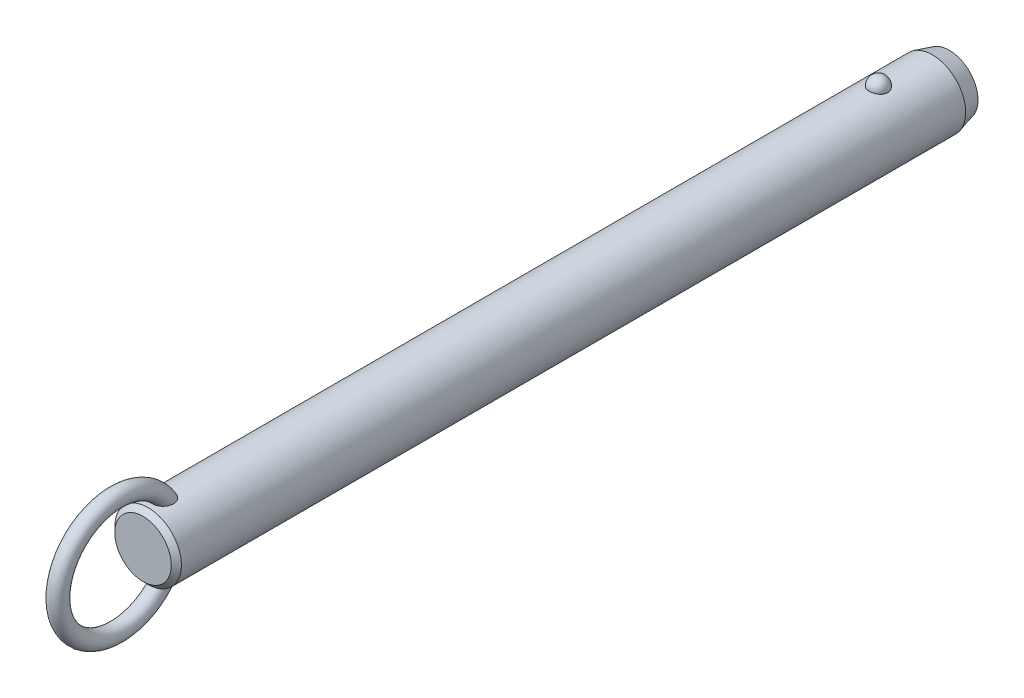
ISO-10303-21;
HEADER;
FILE_DESCRIPTION(('STEP AP214'),'2;1');
FILE_NAME('part.step','',(''),(''),'','','');
FILE_SCHEMA(('AUTOMOTIVE_DESIGN { 1 0 10303 214 1 1 1 1 }'));
ENDSEC;
DATA;
#1=APPLICATION_CONTEXT('core data for automotive mechanical design processes');
#2=APPLICATION_PROTOCOL_DEFINITION('international standard','automotive_design',2000,#1);
#3=PRODUCT_CONTEXT('',#1,'mechanical');
#4=PRODUCT('Part','Part','',(#3));
#5=PRODUCT_RELATED_PRODUCT_CATEGORY('part','',(#4));
#6=PRODUCT_DEFINITION_FORMATION('','',#4);
#7=PRODUCT_DEFINITION_CONTEXT('part definition',#1,'design');
#8=PRODUCT_DEFINITION('design','',#6,#7);
#9=PRODUCT_DEFINITION_SHAPE('','',#8);
#10=(LENGTH_UNIT() NAMED_UNIT(*) SI_UNIT(.MILLI.,.METRE.));
#11=(NAMED_UNIT(*) PLANE_ANGLE_UNIT() SI_UNIT($,.RADIAN.));
#12=(NAMED_UNIT(*) SI_UNIT($,.STERADIAN.) SOLID_ANGLE_UNIT());
#13=UNCERTAINTY_MEASURE_WITH_UNIT(LENGTH_MEASURE(1.E-05),#10,'distance_accuracy_value','');
#14=(GEOMETRIC_REPRESENTATION_CONTEXT(3) GLOBAL_UNCERTAINTY_ASSIGNED_CONTEXT((#13)) GLOBAL_UNIT_ASSIGNED_CONTEXT((#10,
#11,#12)) REPRESENTATION_CONTEXT('',''));
#15=CARTESIAN_POINT('',(0.,0.,0.));
#16=DIRECTION('',(0.,0.,1.));
#17=DIRECTION('',(1.,0.,0.));
#18=AXIS2_PLACEMENT_3D('',#15,#16,#17);
#19=CARTESIAN_POINT('',(0.,0.,162.6));
#20=DIRECTION('',(0.,0.,-1.));
#21=DIRECTION('',(-1.,0.,0.));
#22=AXIS2_PLACEMENT_3D('',#19,#20,#21);
#23=CYLINDRICAL_SURFACE('',#22,7.9);
#24=CARTESIAN_POINT('',(2.1785689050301,7.59367088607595,-2.20000000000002));
#25=CARTESIAN_POINT('',(2.17856679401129,7.59367269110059,-2.07701843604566));
#26=CARTESIAN_POINT('',(2.16853481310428,7.59657145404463,-1.95401006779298));
#27=CARTESIAN_POINT('',(2.12864689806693,7.607843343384,-1.71147811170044));
#28=CARTESIAN_POINT('',(2.09878338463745,7.61621856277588,-1.5919558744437));
#29=CARTESIAN_POINT('',(2.0199931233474,7.63749180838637,-1.35985638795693));
#30=CARTESIAN_POINT('',(1.97107475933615,7.6503878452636,-1.24727610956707));
#31=CARTESIAN_POINT('',(1.85539377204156,7.67926115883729,-1.03213234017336));
#32=CARTESIAN_POINT('',(1.78863158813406,7.69523835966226,-0.929568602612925));
#33=CARTESIAN_POINT('',(1.63856494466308,7.7285848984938,-0.73678633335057));
#34=CARTESIAN_POINT('',(1.55518140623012,7.7459606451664,-0.646630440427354));
#35=CARTESIAN_POINT('',(1.37422937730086,7.78009978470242,-0.481747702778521));
#36=CARTESIAN_POINT('',(1.27666086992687,7.79686317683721,-0.407020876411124));
#37=CARTESIAN_POINT('',(1.07024728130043,7.82786153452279,-0.275278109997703));
#38=CARTESIAN_POINT('',(0.961434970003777,7.84210353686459,-0.218212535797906));
#39=CARTESIAN_POINT('',(0.735351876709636,7.86652194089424,-0.123146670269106));
#40=CARTESIAN_POINT('',(0.618082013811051,7.87669878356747,-0.0851443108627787));
#41=CARTESIAN_POINT('',(0.380637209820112,7.89170521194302,-0.0298158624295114));
#42=CARTESIAN_POINT('',(0.260550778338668,7.89662650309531,-0.0121347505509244));
#43=CARTESIAN_POINT('',(0.0190117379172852,7.90090003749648,0.00324379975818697));
#44=CARTESIAN_POINT('',(-0.102440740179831,7.90025280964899,0.000943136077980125));
#45=CARTESIAN_POINT('',(-0.341452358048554,7.89351056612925,-0.0233955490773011));
#46=CARTESIAN_POINT('',(-0.459042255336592,7.88749257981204,-0.0451545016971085));
#47=CARTESIAN_POINT('',(-0.688796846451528,7.87075812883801,-0.107408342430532));
#48=CARTESIAN_POINT('',(-0.800961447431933,7.86004158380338,-0.14790355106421));
#49=CARTESIAN_POINT('',(-1.01743634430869,7.83497131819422,-0.246799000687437));
#50=CARTESIAN_POINT('',(-1.12169791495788,7.82059709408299,-0.305300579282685));
#51=CARTESIAN_POINT('',(-1.31891765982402,7.78976470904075,-0.43854939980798));
#52=CARTESIAN_POINT('',(-1.41187469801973,7.77330633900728,-0.513298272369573));
#53=CARTESIAN_POINT('',(-1.58577142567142,7.73972434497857,-0.678622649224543));
#54=CARTESIAN_POINT('',(-1.66645140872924,7.72259402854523,-0.769470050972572));
#55=CARTESIAN_POINT('',(-1.81161503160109,7.68983776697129,-0.963538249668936));
#56=CARTESIAN_POINT('',(-1.87609753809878,7.6742119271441,-1.0667599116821));
#57=CARTESIAN_POINT('',(-1.98790138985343,7.6460202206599,-1.28401170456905));
#58=CARTESIAN_POINT('',(-2.03501994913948,7.63349104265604,-1.39815107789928));
#59=CARTESIAN_POINT('',(-2.10986724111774,7.6131449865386,-1.6330178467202));
#60=CARTESIAN_POINT('',(-2.1375965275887,7.60532797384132,-1.75374505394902));
#61=CARTESIAN_POINT('',(-2.17289256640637,7.5953195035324,-1.99782562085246));
#62=CARTESIAN_POINT('',(-2.18054294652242,7.59310471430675,-2.12116592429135));
#63=CARTESIAN_POINT('',(-2.17572919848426,7.59448538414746,-2.36741799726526));
#64=CARTESIAN_POINT('',(-2.1632656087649,7.59808068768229,-2.49032977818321));
#65=CARTESIAN_POINT('',(-2.11865035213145,7.61064035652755,-2.73161015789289));
#66=CARTESIAN_POINT('',(-2.08659579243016,7.61957823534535,-2.84999812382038));
#67=CARTESIAN_POINT('',(-2.00367799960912,7.64179982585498,-3.07955956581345));
#68=CARTESIAN_POINT('',(-1.9528140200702,7.65508371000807,-3.19073275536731));
#69=CARTESIAN_POINT('',(-1.83321113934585,7.68460381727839,-3.40337899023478));
#70=CARTESIAN_POINT('',(-1.76437735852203,7.70085556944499,-3.5047965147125));
#71=CARTESIAN_POINT('',(-1.61069526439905,7.73445734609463,-3.69446912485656));
#72=CARTESIAN_POINT('',(-1.52584634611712,7.75180741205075,-3.78272371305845));
#73=CARTESIAN_POINT('',(-1.34198059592,7.78574608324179,-3.94393987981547));
#74=CARTESIAN_POINT('',(-1.24291308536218,7.80233167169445,-4.01684434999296));
#75=CARTESIAN_POINT('',(-1.03352039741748,7.83281625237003,-4.14489386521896));
#76=CARTESIAN_POINT('',(-0.92319600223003,7.84671543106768,-4.20004014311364));
#77=CARTESIAN_POINT('',(-0.695822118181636,7.87011575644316,-4.29042017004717));
#78=CARTESIAN_POINT('',(-0.578872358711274,7.87966903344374,-4.32589112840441));
#79=CARTESIAN_POINT('',(-0.340410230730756,7.8935652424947,-4.37692226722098));
#80=CARTESIAN_POINT('',(-0.218898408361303,7.89790879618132,-4.39248482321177));
#81=CARTESIAN_POINT('',(0.0228107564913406,7.90087453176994,-4.40314405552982));
#82=CARTESIAN_POINT('',(0.142990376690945,7.89960185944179,-4.39861683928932));
#83=CARTESIAN_POINT('',(0.380829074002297,7.89171262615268,-4.37008293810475));
#84=CARTESIAN_POINT('',(0.498488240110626,7.8850962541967,-4.34607694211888));
#85=CARTESIAN_POINT('',(0.727535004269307,7.86726442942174,-4.27939317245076));
#86=CARTESIAN_POINT('',(0.838944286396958,7.85606616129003,-4.23678512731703));
#87=CARTESIAN_POINT('',(1.05295421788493,7.83025654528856,-4.13408348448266));
#88=CARTESIAN_POINT('',(1.15555431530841,7.81564498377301,-4.07398879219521));
#89=CARTESIAN_POINT('',(1.35076763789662,7.7843022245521,-3.93687432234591));
#90=CARTESIAN_POINT('',(1.4432046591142,7.76754209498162,-3.85961036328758));
#91=CARTESIAN_POINT('',(1.6139111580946,7.73387857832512,-3.69076949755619));
#92=CARTESIAN_POINT('',(1.6921781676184,7.71697516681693,-3.59919010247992));
#93=CARTESIAN_POINT('',(1.83380875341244,7.6845643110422,-3.40247278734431));
#94=CARTESIAN_POINT('',(1.89689280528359,7.66908588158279,-3.29712873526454));
#95=CARTESIAN_POINT('',(2.0047823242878,7.64159441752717,-3.07707931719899));
#96=CARTESIAN_POINT('',(2.0495945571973,7.62958010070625,-2.96237743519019));
#97=CARTESIAN_POINT('',(2.11580183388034,7.61146617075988,-2.74040519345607));
#98=CARTESIAN_POINT('',(2.13929812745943,7.60484503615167,-2.63379846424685));
#99=CARTESIAN_POINT('',(2.17068242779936,7.59594664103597,-2.4181348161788));
#100=CARTESIAN_POINT('',(2.17857077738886,7.59366928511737,-2.30907795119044));
#101=CARTESIAN_POINT('',(2.1785689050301,7.59367088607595,-2.20000000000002));
#102=B_SPLINE_CURVE_WITH_KNOTS('',3,(#24,#25,#26,#27,#28,#29,#30,#31,#32,#33,#34,#35,#36,#37,
#38,#39,#40,#41,#42,#43,#44,#45,#46,#47,#48,#49,#50,#51,#52,#53,#54,#55,#56,#57,#58,#59,#60,#61,
#62,#63,#64,#65,#66,#67,#68,#69,#70,#71,#72,#73,#74,#75,#76,#77,#78,#79,#80,#81,#82,#83,#84,#85,
#86,#87,#88,#89,#90,#91,#92,#93,#94,#95,#96,#97,#98,#99,#100,#101),.UNSPECIFIED.,.T.,.F.,(4,2,2,
2,2,2,2,2,2,2,2,2,2,2,2,2,2,2,2,2,2,2,2,2,2,2,2,2,2,2,2,2,2,2,2,2,2,2,4),(0.,0.368552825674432,
0.737246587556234,1.10577831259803,1.4743009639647,1.8446206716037,2.21494081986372,
2.5842105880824,2.95344028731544,3.31611630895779,3.67875788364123,4.03628044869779,
4.39380913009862,4.75338791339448,5.11300280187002,5.47939989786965,5.8458226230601,
6.21639834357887,6.58696347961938,6.95598276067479,7.32499216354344,7.69218715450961,
8.0593967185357,8.42858578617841,8.79778880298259,9.16834203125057,9.5388695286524,
9.90482699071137,10.2707407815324,10.6298333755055,10.9889132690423,11.3466585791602,
11.7044262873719,12.0676511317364,12.4309391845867,12.8004764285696,13.1698767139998,
13.4967701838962,13.8236564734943),.UNSPECIFIED.);
#103=CARTESIAN_POINT('',(2.1785689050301,7.59367088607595,-2.20000000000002));
#104=VERTEX_POINT('',#103);
#105=EDGE_CURVE('E41',#104,#104,#102,.T.);
#106=ORIENTED_EDGE('',*,*,#105,.T.);
#107=EDGE_LOOP('',(#106));
#108=FACE_BOUND('',#107,.T.);
#109=CARTESIAN_POINT('',(0.,0.,170.92));
#110=DIRECTION('',(0.,0.,1.));
#111=DIRECTION('',(1.,0.,0.));
#112=AXIS2_PLACEMENT_3D('',#109,#110,#111);
#113=CIRCLE('',#112,7.9);
#114=CARTESIAN_POINT('',(7.9,0.,170.92));
#115=VERTEX_POINT('',#114);
#116=EDGE_CURVE('E10',#115,#115,#113,.F.);
#117=ORIENTED_EDGE('',*,*,#116,.T.);
#118=EDGE_LOOP('',(#117));
#119=FACE_BOUND('',#118,.T.);
#120=CARTESIAN_POINT('',(-0.630969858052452,-7.87476203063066,164.812432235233));
#121=CARTESIAN_POINT('',(-0.734180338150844,-7.86648998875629,164.847285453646));
#122=CARTESIAN_POINT('',(-0.834476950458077,-7.85639291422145,164.890816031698));
#123=CARTESIAN_POINT('',(-1.0262035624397,-7.83366343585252,164.994094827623));
#124=CARTESIAN_POINT('',(-1.1176141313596,-7.82102565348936,165.053877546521));
#125=CARTESIAN_POINT('',(-1.28877277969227,-7.79464922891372,165.187839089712));
#126=CARTESIAN_POINT('',(-1.36854014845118,-7.78091246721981,165.261993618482));
#127=CARTESIAN_POINT('',(-1.51461521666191,-7.75380398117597,165.422494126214));
#128=CARTESIAN_POINT('',(-1.58092966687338,-7.74043207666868,165.508833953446));
#129=CARTESIAN_POINT('',(-1.70019064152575,-7.7151252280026,165.692978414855));
#130=CARTESIAN_POINT('',(-1.75284037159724,-7.70322473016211,165.790979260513));
#131=CARTESIAN_POINT('',(-1.84263464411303,-7.68224112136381,165.994102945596));
#132=CARTESIAN_POINT('',(-1.87977299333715,-7.6731591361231,166.099228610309));
#133=CARTESIAN_POINT('',(-1.94152728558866,-7.65777930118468,166.323284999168));
#134=CARTESIAN_POINT('',(-1.96475471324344,-7.65179654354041,166.442616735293));
#135=CARTESIAN_POINT('',(-1.99449499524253,-7.64409642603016,166.68342986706));
#136=CARTESIAN_POINT('',(-2.0010005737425,-7.64238092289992,166.804912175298));
#137=CARTESIAN_POINT('',(-1.99856014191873,-7.64302120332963,167.068340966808));
#138=CARTESIAN_POINT('',(-1.98680021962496,-7.64611845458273,167.21025654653));
#139=CARTESIAN_POINT('',(-1.94457772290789,-7.65696186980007,167.491118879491));
#140=CARTESIAN_POINT('',(-1.91409393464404,-7.66471330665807,167.630062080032));
#141=CARTESIAN_POINT('',(-1.82768670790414,-7.68582947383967,167.931939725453));
#142=CARTESIAN_POINT('',(-1.76772963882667,-7.70003779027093,168.093686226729));
#143=CARTESIAN_POINT('',(-1.65998501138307,-7.72371550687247,168.327695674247));
#144=CARTESIAN_POINT('',(-1.621079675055,-7.73200670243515,168.404297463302));
#145=CARTESIAN_POINT('',(-1.53727726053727,-7.74910377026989,168.554079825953));
#146=CARTESIAN_POINT('',(-1.49238215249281,-7.75790947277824,168.627261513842));
#147=CARTESIAN_POINT('',(-1.37397050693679,-7.77993338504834,168.80288382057));
#148=CARTESIAN_POINT('',(-1.29690364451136,-7.79328473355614,168.902955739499));
#149=CARTESIAN_POINT('',(-1.1288548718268,-7.81939266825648,169.090714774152));
#150=CARTESIAN_POINT('',(-1.0378992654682,-7.83215032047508,169.178424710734));
#151=CARTESIAN_POINT('',(-0.86953281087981,-7.85231710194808,169.313414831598));
#152=CARTESIAN_POINT('',(-0.795716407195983,-7.86021093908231,169.365076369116));
#153=CARTESIAN_POINT('',(-0.640813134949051,-7.87434920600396,169.456381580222));
#154=CARTESIAN_POINT('',(-0.559737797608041,-7.88059619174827,169.49604389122));
#155=CARTESIAN_POINT('',(-0.406456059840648,-7.88984116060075,169.554300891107));
#156=CARTESIAN_POINT('',(-0.335227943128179,-7.89321892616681,169.575384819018));
#157=CARTESIAN_POINT('',(-0.190193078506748,-7.89804235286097,169.60541418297));
#158=CARTESIAN_POINT('',(-0.11638863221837,-7.89948969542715,169.614370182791));
#159=CARTESIAN_POINT('',(0.0318414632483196,-7.90028409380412,169.619291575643));
#160=CARTESIAN_POINT('',(0.106268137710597,-7.89962640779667,169.615227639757));
#161=CARTESIAN_POINT('',(0.253290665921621,-7.8962818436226,169.594461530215));
#162=CARTESIAN_POINT('',(0.325885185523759,-7.8935935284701,169.577750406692));
#163=CARTESIAN_POINT('',(0.481441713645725,-7.88577340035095,169.528738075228));
#164=CARTESIAN_POINT('',(0.563611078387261,-7.88026321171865,169.494005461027));
#165=CARTESIAN_POINT('',(0.721129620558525,-7.86741729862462,169.411796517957));
#166=CARTESIAN_POINT('',(0.796466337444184,-7.86007832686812,169.364297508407));
#167=CARTESIAN_POINT('',(0.971456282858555,-7.84073285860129,169.236513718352));
#168=CARTESIAN_POINT('',(1.06719686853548,-7.82809461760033,169.151004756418));
#169=CARTESIAN_POINT('',(1.24418921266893,-7.80192439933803,168.966232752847));
#170=CARTESIAN_POINT('',(1.32540832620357,-7.78839049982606,168.866939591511));
#171=CARTESIAN_POINT('',(1.45199971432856,-7.76559693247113,168.689576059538));
#172=CARTESIAN_POINT('',(1.50085649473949,-7.75626094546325,168.613954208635));
#173=CARTESIAN_POINT('',(1.59197749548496,-7.7380727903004,168.458742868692));
#174=CARTESIAN_POINT('',(1.63423919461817,-7.72922080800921,168.379151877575));
#175=CARTESIAN_POINT('',(1.71222612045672,-7.71231959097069,168.216664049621));
#176=CARTESIAN_POINT('',(1.74794516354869,-7.70427111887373,168.133764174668));
#177=CARTESIAN_POINT('',(1.81270113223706,-7.68929240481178,167.965296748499));
#178=CARTESIAN_POINT('',(1.84173789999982,-7.68236218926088,167.879729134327));
#179=CARTESIAN_POINT('',(1.89322698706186,-7.6698375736,167.70528702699));
#180=CARTESIAN_POINT('',(1.91558744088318,-7.66426199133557,167.616383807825));
#181=CARTESIAN_POINT('',(1.95281367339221,-7.65485915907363,167.436969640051));
#182=CARTESIAN_POINT('',(1.96767946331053,-7.65103190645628,167.346458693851));
#183=CARTESIAN_POINT('',(2.00021456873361,-7.64262981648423,167.073732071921));
#184=CARTESIAN_POINT('',(2.00600691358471,-7.6410871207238,166.889709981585));
#185=CARTESIAN_POINT('',(1.98445334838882,-7.64669564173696,166.576501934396));
#186=CARTESIAN_POINT('',(1.96607186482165,-7.65149688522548,166.446618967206));
#187=CARTESIAN_POINT('',(1.90884967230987,-7.6659762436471,166.191632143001));
#188=CARTESIAN_POINT('',(1.87002101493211,-7.67565148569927,166.066525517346));
#189=CARTESIAN_POINT('',(1.77063986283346,-7.69918471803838,165.82454013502));
#190=CARTESIAN_POINT('',(1.70993724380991,-7.71307150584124,165.707725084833));
#191=CARTESIAN_POINT('',(1.56733070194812,-7.74330306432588,165.488144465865));
#192=CARTESIAN_POINT('',(1.48543692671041,-7.75964665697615,165.385372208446));
#193=CARTESIAN_POINT('',(1.31346177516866,-7.79047523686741,165.209380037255));
#194=CARTESIAN_POINT('',(1.22547278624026,-7.80495298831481,165.134106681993));
#195=CARTESIAN_POINT('',(1.0372435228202,-7.83218597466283,165.000486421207));
#196=CARTESIAN_POINT('',(0.937008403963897,-7.84494192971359,164.942132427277));
#197=CARTESIAN_POINT('',(0.73359933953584,-7.86649045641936,164.847027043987));
#198=CARTESIAN_POINT('',(0.630941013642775,-7.87547134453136,164.809210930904));
#199=CARTESIAN_POINT('',(0.420465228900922,-7.88950708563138,164.751116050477));
#200=CARTESIAN_POINT('',(0.312645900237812,-7.89456050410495,164.73084369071));
#201=CARTESIAN_POINT('',(0.0960869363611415,-7.9001518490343,164.708455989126));
#202=CARTESIAN_POINT('',(-0.012634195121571,-7.90073226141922,164.706169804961));
#203=CARTESIAN_POINT('',(-0.228766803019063,-7.89742350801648,164.719367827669));
#204=CARTESIAN_POINT('',(-0.336180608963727,-7.89354403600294,164.734813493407));
#205=CARTESIAN_POINT('',(-0.473410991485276,-7.88586871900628,164.766217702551));
#206=CARTESIAN_POINT('',(-0.505257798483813,-7.88388984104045,164.774354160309));
#207=CARTESIAN_POINT('',(-0.568481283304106,-7.87958326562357,164.792208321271));
#208=CARTESIAN_POINT('',(-0.599857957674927,-7.87725556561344,164.801926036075));
#209=CARTESIAN_POINT('',(-0.630969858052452,-7.87476203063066,164.812432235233));
#210=B_SPLINE_CURVE_WITH_KNOTS('',3,(#120,#121,#122,#123,#124,#125,#126,#127,#128,#129,#130,
#131,#132,#133,#134,#135,#136,#137,#138,#139,#140,#141,#142,#143,#144,#145,#146,#147,#148,#149,
#150,#151,#152,#153,#154,#155,#156,#157,#158,#159,#160,#161,#162,#163,#164,#165,#166,#167,#168,
#169,#170,#171,#172,#173,#174,#175,#176,#177,#178,#179,#180,#181,#182,#183,#184,#185,#186,#187,
#188,#189,#190,#191,#192,#193,#194,#195,#196,#197,#198,#199,#200,#201,#202,#203,#204,#205,#206,
#207,#208,#209),.UNSPECIFIED.,.T.,.F.,(4,2,2,2,2,2,2,2,2,2,2,2,2,2,2,2,2,2,2,2,2,2,2,2,2,2,2,2,
2,2,2,2,2,2,2,2,2,2,2,2,2,2,2,2,4),(0.,0.327622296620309,0.655945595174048,0.983718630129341,
1.3113267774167,1.64554655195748,1.97989964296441,2.34365728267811,2.70757317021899,
3.13333684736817,3.55958380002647,4.07655306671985,4.33527897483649,4.59391999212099,
4.97382437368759,5.353017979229,5.62348245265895,5.89352465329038,6.11565959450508,
6.33760092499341,6.56004255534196,6.78264174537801,7.0493084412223,7.31645206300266,
7.70130871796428,8.08701995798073,8.35824509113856,8.62957365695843,8.9011573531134,
9.1727474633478,9.44791855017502,9.72308922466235,10.2715298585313,10.6638393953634,
11.0559179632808,11.4507403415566,11.8453740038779,12.1936425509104,12.5417649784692,
12.8695063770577,13.1973674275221,13.5221104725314,13.8461490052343,13.9449071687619,
14.0436660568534),.UNSPECIFIED.);
#211=CARTESIAN_POINT('',(-0.630969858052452,-7.87476203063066,164.812432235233));
#212=VERTEX_POINT('',#211);
#213=EDGE_CURVE('E59',#212,#212,#210,.T.);
#214=ORIENTED_EDGE('',*,*,#213,.T.);
#215=EDGE_LOOP('',(#214));
#216=FACE_BOUND('',#215,.T.);
#217=CARTESIAN_POINT('',(-0.630969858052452,7.87476203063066,164.812432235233));
#218=CARTESIAN_POINT('',(-0.528918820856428,7.88293636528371,164.777979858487));
#219=CARTESIAN_POINT('',(-0.423745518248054,7.88934810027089,164.751915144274));
#220=CARTESIAN_POINT('',(-0.210236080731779,7.8979273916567,164.717282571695));
#221=CARTESIAN_POINT('',(-0.101893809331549,7.90008607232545,164.708751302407));
#222=CARTESIAN_POINT('',(0.11466056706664,7.89990877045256,164.709457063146));
#223=CARTESIAN_POINT('',(0.222872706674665,7.89757640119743,164.71867980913));
#224=CARTESIAN_POINT('',(0.436107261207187,7.88867538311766,164.754652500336));
#225=CARTESIAN_POINT('',(0.541131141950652,7.8821087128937,164.78139425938));
#226=CARTESIAN_POINT('',(0.745085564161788,7.86545130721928,164.851756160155));
#227=CARTESIAN_POINT('',(0.844015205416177,7.85536005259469,164.895378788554));
#228=CARTESIAN_POINT('',(1.03299167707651,7.83275153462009,164.998379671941));
#229=CARTESIAN_POINT('',(1.12303841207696,7.8202342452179,165.057758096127));
#230=CARTESIAN_POINT('',(1.29214734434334,7.79408219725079,165.190864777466));
#231=CARTESIAN_POINT('',(1.37116907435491,7.78044359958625,165.264643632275));
#232=CARTESIAN_POINT('',(1.51597677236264,7.75353170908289,165.424235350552));
#233=CARTESIAN_POINT('',(1.58176261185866,7.74025841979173,165.510048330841));
#234=CARTESIAN_POINT('',(1.70057386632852,7.71504069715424,165.693644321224));
#235=CARTESIAN_POINT('',(1.75320073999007,7.7031425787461,165.791690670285));
#236=CARTESIAN_POINT('',(1.8429376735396,7.68216822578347,165.994893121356));
#237=CARTESIAN_POINT('',(1.88004278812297,7.67309289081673,166.100051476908));
#238=CARTESIAN_POINT('',(1.9417232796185,7.6577294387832,166.324167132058));
#239=CARTESIAN_POINT('',(1.96491037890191,7.65175648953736,166.443524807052));
#240=CARTESIAN_POINT('',(1.9945689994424,7.64407702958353,166.684384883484));
#241=CARTESIAN_POINT('',(2.00103304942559,7.64237242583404,166.80588821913));
#242=CARTESIAN_POINT('',(1.99850166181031,7.64303650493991,167.069368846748));
#243=CARTESIAN_POINT('',(1.98669038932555,7.64614714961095,167.211314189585));
#244=CARTESIAN_POINT('',(1.94436120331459,7.6570170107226,167.492228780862));
#245=CARTESIAN_POINT('',(1.91382203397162,7.66478150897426,167.631194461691));
#246=CARTESIAN_POINT('',(1.82728754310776,7.68592483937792,167.933111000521));
#247=CARTESIAN_POINT('',(1.76725778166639,7.7001468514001,168.094872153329));
#248=CARTESIAN_POINT('',(1.65939700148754,7.72384204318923,168.328891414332));
#249=CARTESIAN_POINT('',(1.62045187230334,7.73213852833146,168.405494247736));
#250=CARTESIAN_POINT('',(1.53656684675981,7.74924489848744,168.555273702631));
#251=CARTESIAN_POINT('',(1.49162892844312,7.75805461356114,168.628451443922));
#252=CARTESIAN_POINT('',(1.37317698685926,7.78007342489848,168.803952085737));
#253=CARTESIAN_POINT('',(1.29612360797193,7.79341423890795,168.903911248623));
#254=CARTESIAN_POINT('',(1.12812043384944,7.81949839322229,169.09145083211));
#255=CARTESIAN_POINT('',(1.03719688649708,7.83224280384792,169.179054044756));
#256=CARTESIAN_POINT('',(0.868871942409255,7.85239026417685,169.31389715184));
#257=CARTESIAN_POINT('',(0.795056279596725,7.86027769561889,169.365511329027));
#258=CARTESIAN_POINT('',(0.640160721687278,7.87440222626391,169.456720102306));
#259=CARTESIAN_POINT('',(0.55909234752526,7.88064188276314,169.496333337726));
#260=CARTESIAN_POINT('',(0.405820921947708,7.8898738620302,169.554505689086));
#261=CARTESIAN_POINT('',(0.334594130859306,7.89324577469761,169.575552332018));
#262=CARTESIAN_POINT('',(0.189568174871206,7.89805733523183,169.605507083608));
#263=CARTESIAN_POINT('',(0.115771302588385,7.89949866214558,169.614425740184));
#264=CARTESIAN_POINT('',(-0.0324359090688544,7.90028156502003,169.61927589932));
#265=CARTESIAN_POINT('',(-0.106847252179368,7.89961843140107,169.615178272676));
#266=CARTESIAN_POINT('',(-0.253834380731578,7.8962642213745,169.594351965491));
#267=CARTESIAN_POINT('',(-0.326408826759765,7.89357170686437,169.577614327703));
#268=CARTESIAN_POINT('',(-0.481962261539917,7.88574179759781,169.528539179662));
#269=CARTESIAN_POINT('',(-0.564145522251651,7.88022507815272,169.493763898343));
#270=CARTESIAN_POINT('',(-0.7216852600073,7.86736646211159,169.411468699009));
#271=CARTESIAN_POINT('',(-0.797029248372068,7.8600213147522,169.363926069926));
#272=CARTESIAN_POINT('',(-0.972044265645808,7.84066026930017,169.236026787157));
#273=CARTESIAN_POINT('',(-1.06779803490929,7.828012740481,169.150443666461));
#274=CARTESIAN_POINT('',(-1.24480531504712,7.80182621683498,168.965522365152));
#275=CARTESIAN_POINT('',(-1.32602618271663,7.78828530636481,168.866154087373));
#276=CARTESIAN_POINT('',(-1.4525983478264,7.76548487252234,168.688680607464));
#277=CARTESIAN_POINT('',(-1.50143856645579,7.75614818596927,168.613025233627));
#278=CARTESIAN_POINT('',(-1.59252410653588,7.73796020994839,168.457748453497));
#279=CARTESIAN_POINT('',(-1.63476690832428,7.729109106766,168.378125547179));
#280=CARTESIAN_POINT('',(-1.71271318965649,7.71221133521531,168.215575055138));
#281=CARTESIAN_POINT('',(-1.74841047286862,7.70416543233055,168.132644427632));
#282=CARTESIAN_POINT('',(-1.81311929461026,7.6891937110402,167.964116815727));
#283=CARTESIAN_POINT('',(-1.84213067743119,7.68226791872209,167.878519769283));
#284=CARTESIAN_POINT('',(-1.89356259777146,7.66975461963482,167.704025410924));
#285=CARTESIAN_POINT('',(-1.91589165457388,7.66418586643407,167.615099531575));
#286=CARTESIAN_POINT('',(-1.9530507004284,7.65479859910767,167.435642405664));
#287=CARTESIAN_POINT('',(-1.96788069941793,7.65098008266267,167.345111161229));
#288=CARTESIAN_POINT('',(-2.00030078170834,7.64260704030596,167.072327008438));
#289=CARTESIAN_POINT('',(-2.00600576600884,7.64108760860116,166.888271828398));
#290=CARTESIAN_POINT('',(-1.9842848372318,7.64673945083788,166.575080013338));
#291=CARTESIAN_POINT('',(-1.96583698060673,7.65155751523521,166.445240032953));
#292=CARTESIAN_POINT('',(-1.90848948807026,7.66606613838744,166.190361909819));
#293=CARTESIAN_POINT('',(-1.86960376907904,7.67575338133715,166.065320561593));
#294=CARTESIAN_POINT('',(-1.77013421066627,7.6993013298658,165.823500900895));
#295=CARTESIAN_POINT('',(-1.70940488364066,7.71318991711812,165.706784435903));
#296=CARTESIAN_POINT('',(-1.5667295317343,7.74342495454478,165.487340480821));
#297=CARTESIAN_POINT('',(-1.48478316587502,7.75977144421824,165.38461321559));
#298=CARTESIAN_POINT('',(-1.31266325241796,7.79061163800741,165.208643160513));
#299=CARTESIAN_POINT('',(-1.22456383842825,7.80509908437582,165.133358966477));
#300=CARTESIAN_POINT('',(-1.03622400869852,7.83231881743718,164.999865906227));
#301=CARTESIAN_POINT('',(-0.93601531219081,7.84505551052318,164.941613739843));
#302=CARTESIAN_POINT('',(-0.798824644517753,7.85957802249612,164.877540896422));
#303=CARTESIAN_POINT('',(-0.765787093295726,7.86286821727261,164.863224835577));
#304=CARTESIAN_POINT('',(-0.698939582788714,7.86909211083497,164.836436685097));
#305=CARTESIAN_POINT('',(-0.665129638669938,7.8720258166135,164.823964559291));
#306=CARTESIAN_POINT('',(-0.630969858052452,7.87476203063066,164.812432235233));
#307=B_SPLINE_CURVE_WITH_KNOTS('',3,(#217,#218,#219,#220,#221,#222,#223,#224,#225,#226,#227,
#228,#229,#230,#231,#232,#233,#234,#235,#236,#237,#238,#239,#240,#241,#242,#243,#244,#245,#246,
#247,#248,#249,#250,#251,#252,#253,#254,#255,#256,#257,#258,#259,#260,#261,#262,#263,#264,#265,
#266,#267,#268,#269,#270,#271,#272,#273,#274,#275,#276,#277,#278,#279,#280,#281,#282,#283,#284,
#285,#286,#287,#288,#289,#290,#291,#292,#293,#294,#295,#296,#297,#298,#299,#300,#301,#302,#303,
#304,#305,#306),.UNSPECIFIED.,.T.,.F.,(4,2,2,2,2,2,2,2,2,2,2,2,2,2,2,2,2,2,2,2,2,2,2,2,2,2,2,2,
2,2,2,2,2,2,2,2,2,2,2,2,2,2,2,2,4),(0.,0.323920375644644,0.648516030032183,0.972850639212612,
1.29703380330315,1.62126473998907,1.94549915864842,2.27089401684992,2.59629203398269,
2.93059633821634,3.26500707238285,3.6288164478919,3.99278833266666,4.41865421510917,
4.84500434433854,5.36209210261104,5.62087589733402,5.87957448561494,6.25918598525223,
6.63808782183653,6.90846748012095,7.17842501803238,7.40052350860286,7.62242871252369,
7.84483086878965,8.0673907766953,8.33414615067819,8.60137921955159,8.98641454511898,
9.37230415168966,9.64358673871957,9.91497268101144,10.1866142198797,10.4582620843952,
10.7334745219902,11.008686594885,11.5572126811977,11.9494246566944,12.3413699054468,
12.7359755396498,13.1305875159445,13.4791770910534,13.82687259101,13.9353013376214,
14.0437279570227),.UNSPECIFIED.);
#308=CARTESIAN_POINT('',(-0.630969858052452,7.87476203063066,164.812432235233));
#309=VERTEX_POINT('',#308);
#310=EDGE_CURVE('E67',#309,#309,#307,.T.);
#311=ORIENTED_EDGE('',*,*,#310,.T.);
#312=EDGE_LOOP('',(#311));
#313=FACE_BOUND('',#312,.T.);
#314=CARTESIAN_POINT('',(0.,0.,-15.));
#315=DIRECTION('',(0.,0.,-1.));
#316=DIRECTION('',(-1.,0.,0.));
#317=AXIS2_PLACEMENT_3D('',#314,#315,#316);
#318=CIRCLE('',#317,7.9);
#319=CARTESIAN_POINT('',(-7.9,0.,-15.));
#320=VERTEX_POINT('',#319);
#321=EDGE_CURVE('E56',#320,#320,#318,.F.);
#322=ORIENTED_EDGE('',*,*,#321,.T.);
#323=EDGE_LOOP('',(#322));
#324=FACE_BOUND('',#323,.T.);
#325=ADVANCED_FACE('F37',(#108,#119,#216,#313,#324),#23,.T.);
#326=CARTESIAN_POINT('',(0.,0.,-19.));
#327=DIRECTION('',(0.,0.,-1.));
#328=DIRECTION('',(-1.,0.,0.));
#329=AXIS2_PLACEMENT_3D('',#326,#327,#328);
#330=PLANE('',#329);
#331=CARTESIAN_POINT('',(0.,0.,-19.));
#332=DIRECTION('',(0.,0.,-1.));
#333=DIRECTION('',(-1.,0.,0.));
#334=AXIS2_PLACEMENT_3D('',#331,#332,#333);
#335=CIRCLE('',#334,6.82820323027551);
#336=CARTESIAN_POINT('',(-6.82820323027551,0.,-19.));
#337=VERTEX_POINT('',#336);
#338=EDGE_CURVE('E66',#337,#337,#335,.T.);
#339=ORIENTED_EDGE('',*,*,#338,.T.);
#340=EDGE_LOOP('',(#339));
#341=FACE_BOUND('',#340,.T.);
#342=ADVANCED_FACE('F85',(#341),#330,.T.);
#343=CARTESIAN_POINT('',(0.,0.,-19.));
#344=DIRECTION('',(0.,0.,1.));
#345=DIRECTION('',(1.,0.,0.));
#346=AXIS2_PLACEMENT_3D('',#343,#344,#345);
#347=CONICAL_SURFACE('',#346,6.82820323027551,0.261799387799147);
#348=ORIENTED_EDGE('',*,*,#321,.F.);
#349=EDGE_LOOP('',(#348));
#350=FACE_BOUND('',#349,.T.);
#351=ORIENTED_EDGE('',*,*,#338,.F.);
#352=EDGE_LOOP('',(#351));
#353=FACE_BOUND('',#352,.T.);
#354=ADVANCED_FACE('F83',(#350,#353),#347,.T.);
#355=CARTESIAN_POINT('',(0.,0.,172.12));
#356=DIRECTION('',(0.,0.,1.));
#357=DIRECTION('',(1.,0.,0.));
#358=AXIS2_PLACEMENT_3D('',#355,#356,#357);
#359=PLANE('',#358);
#360=CARTESIAN_POINT('',(0.,0.,172.12));
#361=DIRECTION('',(0.,0.,1.));
#362=DIRECTION('',(1.,0.,0.));
#363=AXIS2_PLACEMENT_3D('',#360,#361,#362);
#364=CIRCLE('',#363,6.69999999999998);
#365=CARTESIAN_POINT('',(6.69999999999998,0.,172.12));
#366=VERTEX_POINT('',#365);
#367=EDGE_CURVE('E50',#366,#366,#364,.T.);
#368=ORIENTED_EDGE('',*,*,#367,.T.);
#369=EDGE_LOOP('',(#368));
#370=FACE_BOUND('',#369,.T.);
#371=ADVANCED_FACE('F77',(#370),#359,.T.);
#372=CARTESIAN_POINT('',(0.,0.,178.45));
#373=DIRECTION('',(1.,0.,0.));
#374=DIRECTION('',(0.,0.,-1.));
#375=AXIS2_PLACEMENT_3D('',#372,#373,#374);
#376=TOROIDAL_SURFACE('',#375,13.85,2.);
#377=ORIENTED_EDGE('',*,*,#310,.F.);
#378=EDGE_LOOP('',(#377));
#379=FACE_BOUND('',#378,.T.);
#380=ORIENTED_EDGE('',*,*,#213,.F.);
#381=EDGE_LOOP('',(#380));
#382=FACE_BOUND('',#381,.T.);
#383=ADVANCED_FACE('F73',(#379,#382),#376,.T.);
#384=CARTESIAN_POINT('',(0.,0.,172.12));
#385=DIRECTION('',(0.,0.,-1.));
#386=DIRECTION('',(-1.,0.,0.));
#387=AXIS2_PLACEMENT_3D('',#384,#385,#386);
#388=CONICAL_SURFACE('',#387,6.69999999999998,0.785398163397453);
#389=ORIENTED_EDGE('',*,*,#116,.F.);
#390=EDGE_LOOP('',(#389));
#391=FACE_BOUND('',#390,.T.);
#392=ORIENTED_EDGE('',*,*,#367,.F.);
#393=EDGE_LOOP('',(#392));
#394=FACE_BOUND('',#393,.T.);
#395=ADVANCED_FACE('F39',(#391,#394),#388,.T.);
#396=CARTESIAN_POINT('',(0.,7.9,-2.20000000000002));
#397=DIRECTION('',(0.,1.,0.));
#398=DIRECTION('',(0.,0.,1.));
#399=AXIS2_PLACEMENT_3D('',#396,#397,#398);
#400=SPHERICAL_SURFACE('',#399,2.2);
#401=ORIENTED_EDGE('',*,*,#105,.F.);
#402=EDGE_LOOP('',(#401));
#403=FACE_BOUND('',#402,.T.);
#404=ADVANCED_FACE('F79',(#403),#400,.T.);
#405=CLOSED_SHELL('',(#325,#342,#354,#371,#383,#395,#404));
#406=MANIFOLD_SOLID_BREP('B2',#405);
#407=ADVANCED_BREP_SHAPE_REPRESENTATION('',(#18,#406),#14);
#408=SHAPE_DEFINITION_REPRESENTATION(#9,#407);
ENDSEC;
END-ISO-10303-21;
